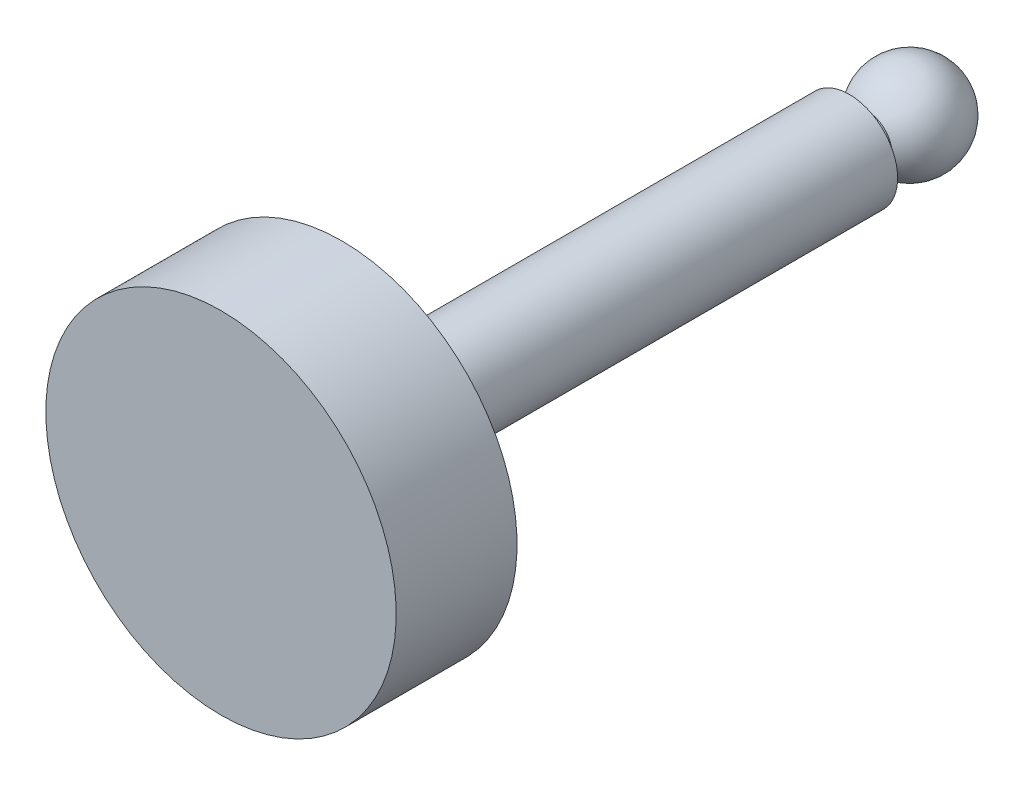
ISO-10303-21;
HEADER;
FILE_DESCRIPTION(('STEP AP214'),'2;1');
FILE_NAME('part.step','',(''),(''),'','','');
FILE_SCHEMA(('AUTOMOTIVE_DESIGN { 1 0 10303 214 1 1 1 1 }'));
ENDSEC;
DATA;
#1=APPLICATION_CONTEXT('core data for automotive mechanical design processes');
#2=APPLICATION_PROTOCOL_DEFINITION('international standard','automotive_design',2000,#1);
#3=PRODUCT_CONTEXT('',#1,'mechanical');
#4=PRODUCT('Part','Part','',(#3));
#5=PRODUCT_RELATED_PRODUCT_CATEGORY('part','',(#4));
#6=PRODUCT_DEFINITION_FORMATION('','',#4);
#7=PRODUCT_DEFINITION_CONTEXT('part definition',#1,'design');
#8=PRODUCT_DEFINITION('design','',#6,#7);
#9=PRODUCT_DEFINITION_SHAPE('','',#8);
#10=(LENGTH_UNIT() NAMED_UNIT(*) SI_UNIT(.MILLI.,.METRE.));
#11=(NAMED_UNIT(*) PLANE_ANGLE_UNIT() SI_UNIT($,.RADIAN.));
#12=(NAMED_UNIT(*) SI_UNIT($,.STERADIAN.) SOLID_ANGLE_UNIT());
#13=UNCERTAINTY_MEASURE_WITH_UNIT(LENGTH_MEASURE(1.E-05),#10,'distance_accuracy_value','');
#14=(GEOMETRIC_REPRESENTATION_CONTEXT(3) GLOBAL_UNCERTAINTY_ASSIGNED_CONTEXT((#13)) GLOBAL_UNIT_ASSIGNED_CONTEXT((#10,
#11,#12)) REPRESENTATION_CONTEXT('',''));
#15=CARTESIAN_POINT('',(0.,0.,0.));
#16=DIRECTION('',(0.,0.,1.));
#17=DIRECTION('',(1.,0.,0.));
#18=AXIS2_PLACEMENT_3D('',#15,#16,#17);
#19=CARTESIAN_POINT('',(0.,-14.5,61.));
#20=DIRECTION('',(0.,0.,-1.));
#21=DIRECTION('',(0.,-1.,0.));
#22=AXIS2_PLACEMENT_3D('',#19,#20,#21);
#23=PLANE('',#22);
#24=CARTESIAN_POINT('',(0.,0.,61.));
#25=DIRECTION('',(0.,0.,1.));
#26=DIRECTION('',(0.,1.,0.));
#27=AXIS2_PLACEMENT_3D('',#24,#25,#26);
#28=CIRCLE('',#27,14.5);
#29=CARTESIAN_POINT('',(0.,14.5,61.));
#30=VERTEX_POINT('',#29);
#31=EDGE_CURVE('E34',#30,#30,#28,.T.);
#32=ORIENTED_EDGE('',*,*,#31,.T.);
#33=EDGE_LOOP('',(#32));
#34=FACE_BOUND('',#33,.T.);
#35=ADVANCED_FACE('F12',(#34),#23,.F.);
#36=CARTESIAN_POINT('',(0.,0.,4.));
#37=DIRECTION('',(0.,-1.,0.));
#38=DIRECTION('',(-1.,0.,0.));
#39=AXIS2_PLACEMENT_3D('',#36,#37,#38);
#40=SPHERICAL_SURFACE('',#39,4.);
#41=CARTESIAN_POINT('',(0.,0.,4.));
#42=DIRECTION('',(0.,0.,1.));
#43=DIRECTION('',(0.,1.,0.));
#44=AXIS2_PLACEMENT_3D('',#41,#42,#43);
#45=SPHERICAL_SURFACE('',#44,4.);
#46=CARTESIAN_POINT('',(0.,0.,7.46410161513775));
#47=DIRECTION('',(0.,0.,1.));
#48=DIRECTION('',(0.,1.,0.));
#49=AXIS2_PLACEMENT_3D('',#46,#47,#48);
#50=CIRCLE('',#49,2.);
#51=CARTESIAN_POINT('',(0.,2.,7.46410161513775));
#52=VERTEX_POINT('',#51);
#53=EDGE_CURVE('E8',#52,#52,#50,.T.);
#54=ORIENTED_EDGE('',*,*,#53,.F.);
#55=EDGE_LOOP('',(#54));
#56=FACE_BOUND('',#55,.T.);
#57=ADVANCED_FACE('F63',(#56),#45,.T.);
#58=CARTESIAN_POINT('',(0.,0.,61.));
#59=DIRECTION('',(0.,0.,1.));
#60=DIRECTION('',(0.,1.,0.));
#61=AXIS2_PLACEMENT_3D('',#58,#59,#60);
#62=CYLINDRICAL_SURFACE('',#61,2.);
#63=ORIENTED_EDGE('',*,*,#53,.T.);
#64=EDGE_LOOP('',(#63));
#65=FACE_BOUND('',#64,.T.);
#66=CARTESIAN_POINT('',(0.,0.,9.));
#67=DIRECTION('',(0.,0.,1.));
#68=DIRECTION('',(0.,1.,0.));
#69=AXIS2_PLACEMENT_3D('',#66,#67,#68);
#70=CIRCLE('',#69,2.);
#71=CARTESIAN_POINT('',(0.,2.,9.));
#72=VERTEX_POINT('',#71);
#73=EDGE_CURVE('E18',#72,#72,#70,.T.);
#74=ORIENTED_EDGE('',*,*,#73,.F.);
#75=EDGE_LOOP('',(#74));
#76=FACE_BOUND('',#75,.T.);
#77=ADVANCED_FACE('F60',(#65,#76),#62,.T.);
#78=CARTESIAN_POINT('',(0.,-4.,9.));
#79=DIRECTION('',(0.,0.,-1.));
#80=DIRECTION('',(0.,-1.,0.));
#81=AXIS2_PLACEMENT_3D('',#78,#79,#80);
#82=PLANE('',#81);
#83=ORIENTED_EDGE('',*,*,#73,.T.);
#84=EDGE_LOOP('',(#83));
#85=FACE_BOUND('',#84,.T.);
#86=CARTESIAN_POINT('',(0.,0.,9.));
#87=DIRECTION('',(0.,0.,1.));
#88=DIRECTION('',(0.,1.,0.));
#89=AXIS2_PLACEMENT_3D('',#86,#87,#88);
#90=CIRCLE('',#89,4.);
#91=CARTESIAN_POINT('',(0.,4.,9.));
#92=VERTEX_POINT('',#91);
#93=EDGE_CURVE('E22',#92,#92,#90,.T.);
#94=ORIENTED_EDGE('',*,*,#93,.F.);
#95=EDGE_LOOP('',(#94));
#96=FACE_BOUND('',#95,.T.);
#97=ADVANCED_FACE('F53',(#85,#96),#82,.T.);
#98=CARTESIAN_POINT('',(0.,0.,61.));
#99=DIRECTION('',(0.,0.,1.));
#100=DIRECTION('',(0.,1.,0.));
#101=AXIS2_PLACEMENT_3D('',#98,#99,#100);
#102=CYLINDRICAL_SURFACE('',#101,4.);
#103=ORIENTED_EDGE('',*,*,#93,.T.);
#104=EDGE_LOOP('',(#103));
#105=FACE_BOUND('',#104,.T.);
#106=CARTESIAN_POINT('',(0.,0.,51.));
#107=DIRECTION('',(0.,0.,1.));
#108=DIRECTION('',(0.,1.,0.));
#109=AXIS2_PLACEMENT_3D('',#106,#107,#108);
#110=CIRCLE('',#109,4.);
#111=CARTESIAN_POINT('',(0.,4.,51.));
#112=VERTEX_POINT('',#111);
#113=EDGE_CURVE('E26',#112,#112,#110,.T.);
#114=ORIENTED_EDGE('',*,*,#113,.F.);
#115=EDGE_LOOP('',(#114));
#116=FACE_BOUND('',#115,.T.);
#117=ADVANCED_FACE('F48',(#105,#116),#102,.T.);
#118=CARTESIAN_POINT('',(0.,-4.,51.));
#119=DIRECTION('',(0.,0.,1.));
#120=DIRECTION('',(0.,1.,0.));
#121=AXIS2_PLACEMENT_3D('',#118,#119,#120);
#122=PLANE('',#121);
#123=CARTESIAN_POINT('',(0.,0.,51.));
#124=DIRECTION('',(0.,0.,1.));
#125=DIRECTION('',(0.,1.,0.));
#126=AXIS2_PLACEMENT_3D('',#123,#124,#125);
#127=CIRCLE('',#126,14.5);
#128=CARTESIAN_POINT('',(0.,14.5,51.));
#129=VERTEX_POINT('',#128);
#130=EDGE_CURVE('E31',#129,#129,#127,.T.);
#131=ORIENTED_EDGE('',*,*,#130,.F.);
#132=EDGE_LOOP('',(#131));
#133=FACE_BOUND('',#132,.T.);
#134=ORIENTED_EDGE('',*,*,#113,.T.);
#135=EDGE_LOOP('',(#134));
#136=FACE_BOUND('',#135,.T.);
#137=ADVANCED_FACE('F42',(#133,#136),#122,.F.);
#138=CARTESIAN_POINT('',(0.,0.,61.));
#139=DIRECTION('',(0.,0.,1.));
#140=DIRECTION('',(0.,1.,0.));
#141=AXIS2_PLACEMENT_3D('',#138,#139,#140);
#142=CYLINDRICAL_SURFACE('',#141,14.5);
#143=ORIENTED_EDGE('',*,*,#31,.F.);
#144=EDGE_LOOP('',(#143));
#145=FACE_BOUND('',#144,.T.);
#146=ORIENTED_EDGE('',*,*,#130,.T.);
#147=EDGE_LOOP('',(#146));
#148=FACE_BOUND('',#147,.T.);
#149=ADVANCED_FACE('F39',(#145,#148),#142,.T.);
#150=CLOSED_SHELL('',(#35,#57,#77,#97,#117,#137,#149));
#151=MANIFOLD_SOLID_BREP('B1',#150);
#152=ADVANCED_BREP_SHAPE_REPRESENTATION('',(#18,#151),#14);
#153=SHAPE_DEFINITION_REPRESENTATION(#9,#152);
ENDSEC;
END-ISO-10303-21;
